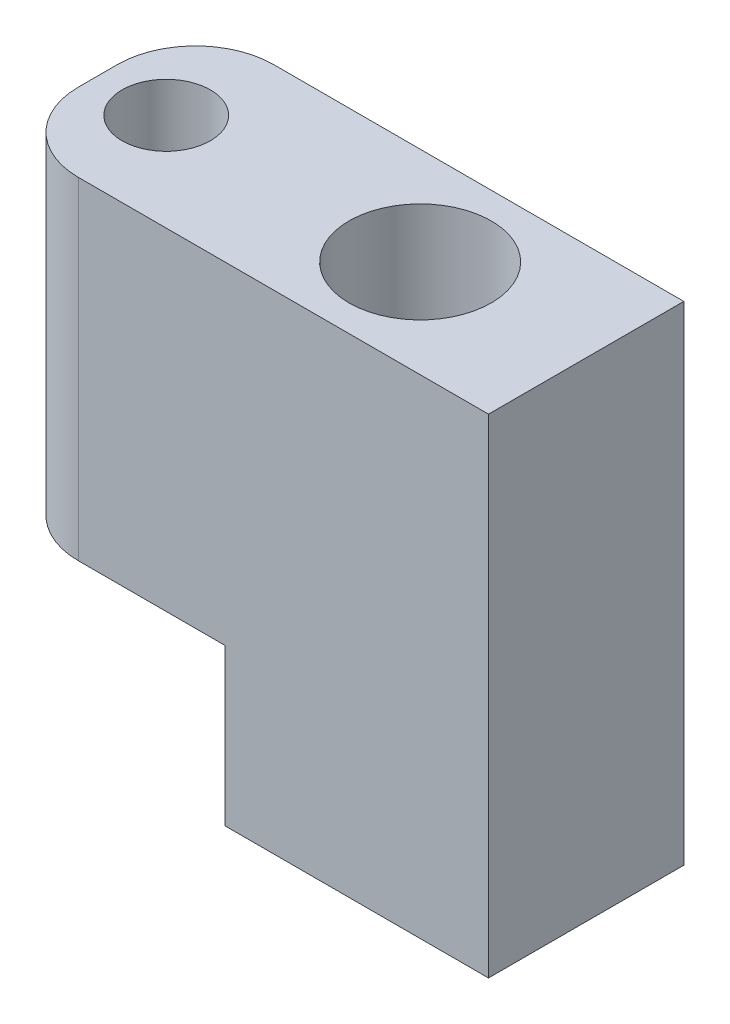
from build123d import *

# Parameters (mm, degrees)
BOSS_EXTRUDE1_DEPTH         = 15.875
SKETCH3_W                   = 22.225
SKETCH3_H                   = 5.08
CUT_EXTRUDE1_DEPTH          = 36.225333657
F_14_0_182_DIAMETER_HOLE1_D = 4.6228
F_6_40_TAPPED_HOLE1_D       = 2.8702


with BuildPart() as part:
    # Sketch2 → Boss-Extrude1 (new body)
    with BuildSketch(Plane(origin=(0, 0, 0), x_dir=(1, 0, 0), z_dir=(0, 1, 0))):
        with BuildLine():
            Line((17.4625, 3.175), (30.7975, 3.175))
            Line((30.7975, 3.175), (30.7975, -3.175))
            Line((30.7975, -3.175), (17.4625, -3.175))
            ThreePointArc((17.4625, -3.175), (15.666448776, -2.431051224), (14.9225, -0.635))
            Line((14.9225, -0.635), (14.9225, 0.635))
            ThreePointArc((14.9225, 0.635), (15.666448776, 2.431051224), (17.4625, 3.175))
        make_face()
    extrude(amount=BOSS_EXTRUDE1_DEPTH)

    # Sketch3 → Cut-Extrude1 (cut, through all)
    with BuildSketch(Plane.XY.offset(3.175)):
        with Locations((11.1125, 2.54)):
            Rectangle(SKETCH3_W, SKETCH3_H)
    extrude(amount=-CUT_EXTRUDE1_DEPTH, mode=Mode.SUBTRACT)

    # 14 _0.182_ Diameter Hole1 (through all)
    with Locations(Plane(origin=(0, 15.875, 0), x_dir=(1, 0, 0), z_dir=(0, 1, 0))):
        with Locations((25.4, 0)):
            Hole(F_14_0_182_DIAMETER_HOLE1_D / 2)

    # 6-40 Tapped Hole1 (through all)
    with Locations(Plane(origin=(0, 15.875, 0), x_dir=(1, 0, 0), z_dir=(0, 1, 0))):
        with Locations((17.145, 0)):
            Hole(F_6_40_TAPPED_HOLE1_D / 2)


solid = part.part
